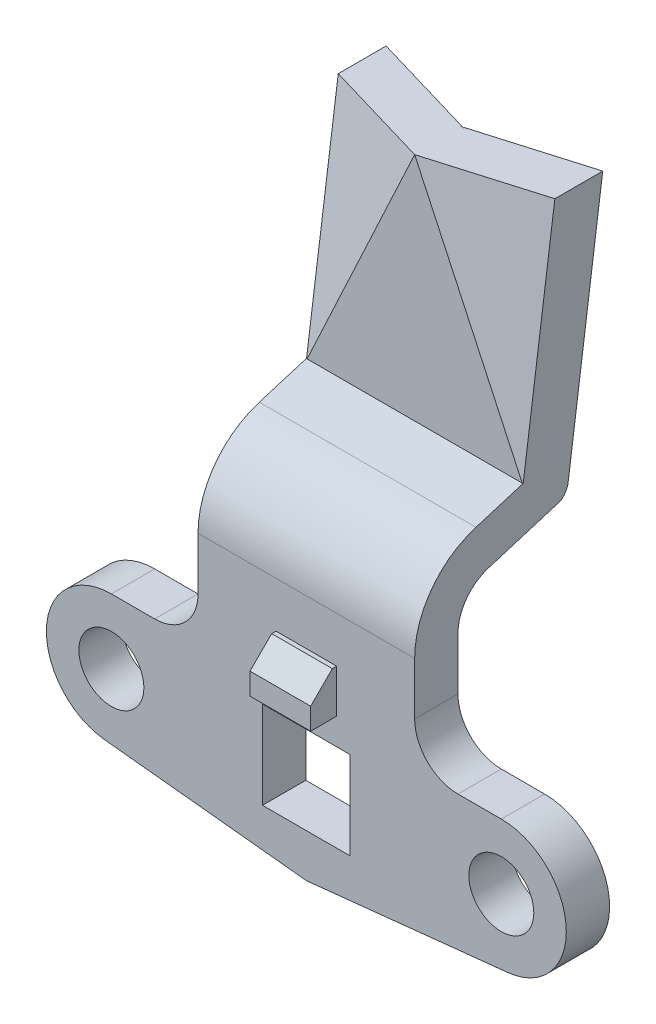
ISO-10303-21;
HEADER;
FILE_DESCRIPTION(('STEP AP214'),'2;1');
FILE_NAME('part.step','',(''),(''),'','','');
FILE_SCHEMA(('AUTOMOTIVE_DESIGN { 1 0 10303 214 1 1 1 1 }'));
ENDSEC;
DATA;
#1=APPLICATION_CONTEXT('core data for automotive mechanical design processes');
#2=APPLICATION_PROTOCOL_DEFINITION('international standard','automotive_design',2000,#1);
#3=PRODUCT_CONTEXT('',#1,'mechanical');
#4=PRODUCT('Part','Part','',(#3));
#5=PRODUCT_RELATED_PRODUCT_CATEGORY('part','',(#4));
#6=PRODUCT_DEFINITION_FORMATION('','',#4);
#7=PRODUCT_DEFINITION_CONTEXT('part definition',#1,'design');
#8=PRODUCT_DEFINITION('design','',#6,#7);
#9=PRODUCT_DEFINITION_SHAPE('','',#8);
#10=(LENGTH_UNIT() NAMED_UNIT(*) SI_UNIT(.MILLI.,.METRE.));
#11=(NAMED_UNIT(*) PLANE_ANGLE_UNIT() SI_UNIT($,.RADIAN.));
#12=(NAMED_UNIT(*) SI_UNIT($,.STERADIAN.) SOLID_ANGLE_UNIT());
#13=UNCERTAINTY_MEASURE_WITH_UNIT(LENGTH_MEASURE(1.E-05),#10,'distance_accuracy_value','');
#14=(GEOMETRIC_REPRESENTATION_CONTEXT(3) GLOBAL_UNCERTAINTY_ASSIGNED_CONTEXT((#13)) GLOBAL_UNIT_ASSIGNED_CONTEXT((#10,
#11,#12)) REPRESENTATION_CONTEXT('',''));
#15=CARTESIAN_POINT('',(0.,0.,0.));
#16=DIRECTION('',(0.,0.,1.));
#17=DIRECTION('',(1.,0.,0.));
#18=AXIS2_PLACEMENT_3D('',#15,#16,#17);
#19=CARTESIAN_POINT('',(-24.,14.7228488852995,0.));
#20=DIRECTION('',(0.,0.,1.));
#21=DIRECTION('',(0.,1.,0.));
#22=AXIS2_PLACEMENT_3D('',#19,#20,#21);
#23=PLANE('',#22);
#24=DIRECTION('',(0.,-1.,0.));
#25=VECTOR('',#24,1.);
#26=CARTESIAN_POINT('',(-2.8,10.5,0.));
#27=LINE('',#26,#25);
#28=CARTESIAN_POINT('',(-2.8,10.5,0.));
#29=VERTEX_POINT('',#28);
#30=CARTESIAN_POINT('',(-2.8,6.5,0.));
#31=VERTEX_POINT('',#30);
#32=EDGE_CURVE('E285',#29,#31,#27,.T.);
#33=ORIENTED_EDGE('',*,*,#32,.F.);
#34=DIRECTION('',(1.,0.,0.));
#35=VECTOR('',#34,1.);
#36=CARTESIAN_POINT('',(-2.8,10.5,0.));
#37=LINE('',#36,#35);
#38=CARTESIAN_POINT('',(2.8,10.5,0.));
#39=VERTEX_POINT('',#38);
#40=EDGE_CURVE('E278',#29,#39,#37,.T.);
#41=ORIENTED_EDGE('',*,*,#40,.T.);
#42=DIRECTION('',(0.,1.,0.));
#43=VECTOR('',#42,1.);
#44=CARTESIAN_POINT('',(2.8,6.5,0.));
#45=LINE('',#44,#43);
#46=CARTESIAN_POINT('',(2.8,6.5,0.));
#47=VERTEX_POINT('',#46);
#48=EDGE_CURVE('E280',#47,#39,#45,.T.);
#49=ORIENTED_EDGE('',*,*,#48,.F.);
#50=DIRECTION('',(-1.,0.,0.));
#51=VECTOR('',#50,1.);
#52=CARTESIAN_POINT('',(2.8,6.5,0.));
#53=LINE('',#52,#51);
#54=EDGE_CURVE('E283',#47,#31,#53,.T.);
#55=ORIENTED_EDGE('',*,*,#54,.T.);
#56=EDGE_LOOP('',(#33,#41,#49,#55));
#57=FACE_BOUND('',#56,.T.);
#58=CARTESIAN_POINT('',(14.,9.87492591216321,0.));
#59=DIRECTION('',(0.,0.,-1.));
#60=DIRECTION('',(0.,-1.,0.));
#61=AXIS2_PLACEMENT_3D('',#58,#59,#60);
#62=CIRCLE('',#61,4.);
#63=CARTESIAN_POINT('',(14.,5.87492591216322,0.));
#64=VERTEX_POINT('',#63);
#65=CARTESIAN_POINT('',(10.,9.87492591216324,0.));
#66=VERTEX_POINT('',#65);
#67=EDGE_CURVE('E362',#64,#66,#62,.T.);
#68=ORIENTED_EDGE('',*,*,#67,.T.);
#69=DIRECTION('',(0.,1.,0.));
#70=VECTOR('',#69,1.);
#71=CARTESIAN_POINT('',(10.,9.87492591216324,0.));
#72=LINE('',#71,#70);
#73=CARTESIAN_POINT('',(10.,14.7228488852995,0.));
#74=VERTEX_POINT('',#73);
#75=EDGE_CURVE('E365',#66,#74,#72,.T.);
#76=ORIENTED_EDGE('',*,*,#75,.T.);
#77=DIRECTION('',(1.,0.,0.));
#78=VECTOR('',#77,1.);
#79=CARTESIAN_POINT('',(-24.,14.7228488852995,0.));
#80=LINE('',#79,#78);
#81=CARTESIAN_POINT('',(-10.,14.7228488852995,0.));
#82=VERTEX_POINT('',#81);
#83=EDGE_CURVE('E614',#82,#74,#80,.T.);
#84=ORIENTED_EDGE('',*,*,#83,.F.);
#85=DIRECTION('',(0.,1.,0.));
#86=VECTOR('',#85,1.);
#87=CARTESIAN_POINT('',(-10.,9.87492591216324,0.));
#88=LINE('',#87,#86);
#89=CARTESIAN_POINT('',(-10.,9.87492591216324,0.));
#90=VERTEX_POINT('',#89);
#91=EDGE_CURVE('E368',#90,#82,#88,.T.);
#92=ORIENTED_EDGE('',*,*,#91,.F.);
#93=CARTESIAN_POINT('',(-14.,9.87492591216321,0.));
#94=DIRECTION('',(0.,0.,1.));
#95=DIRECTION('',(0.,1.,0.));
#96=AXIS2_PLACEMENT_3D('',#93,#94,#95);
#97=CIRCLE('',#96,4.);
#98=CARTESIAN_POINT('',(-14.,5.87492591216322,0.));
#99=VERTEX_POINT('',#98);
#100=EDGE_CURVE('E370',#99,#90,#97,.T.);
#101=ORIENTED_EDGE('',*,*,#100,.F.);
#102=DIRECTION('',(1.,0.,0.));
#103=VECTOR('',#102,1.);
#104=CARTESIAN_POINT('',(-18.,5.87492591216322,0.));
#105=LINE('',#104,#103);
#106=CARTESIAN_POINT('',(-18.,5.87492591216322,0.));
#107=VERTEX_POINT('',#106);
#108=EDGE_CURVE('E373',#107,#99,#105,.T.);
#109=ORIENTED_EDGE('',*,*,#108,.F.);
#110=CARTESIAN_POINT('',(-18.,-0.125074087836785,0.));
#111=DIRECTION('',(0.,0.,1.));
#112=DIRECTION('',(0.,1.,0.));
#113=AXIS2_PLACEMENT_3D('',#110,#111,#112);
#114=CIRCLE('',#113,6.);
#115=CARTESIAN_POINT('',(-18.6271707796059,-6.09220546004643,0.));
#116=VERTEX_POINT('',#115);
#117=EDGE_CURVE('E376',#107,#116,#114,.T.);
#118=ORIENTED_EDGE('',*,*,#117,.T.);
#119=DIRECTION('',(-0.994521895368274,0.10452846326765,0.));
#120=VECTOR('',#119,1.);
#121=CARTESIAN_POINT('',(0.,-8.05,0.));
#122=LINE('',#121,#120);
#123=CARTESIAN_POINT('',(0.,-8.05,0.));
#124=VERTEX_POINT('',#123);
#125=EDGE_CURVE('E378',#124,#116,#122,.T.);
#126=ORIENTED_EDGE('',*,*,#125,.F.);
#127=DIRECTION('',(0.994521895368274,0.10452846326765,0.));
#128=VECTOR('',#127,1.);
#129=CARTESIAN_POINT('',(0.,-8.05,0.));
#130=LINE('',#129,#128);
#131=CARTESIAN_POINT('',(18.6271707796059,-6.09220546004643,0.));
#132=VERTEX_POINT('',#131);
#133=EDGE_CURVE('E353',#124,#132,#130,.T.);
#134=ORIENTED_EDGE('',*,*,#133,.T.);
#135=CARTESIAN_POINT('',(18.,-0.125074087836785,0.));
#136=DIRECTION('',(0.,0.,-1.));
#137=DIRECTION('',(0.,-1.,0.));
#138=AXIS2_PLACEMENT_3D('',#135,#136,#137);
#139=CIRCLE('',#138,6.);
#140=CARTESIAN_POINT('',(18.,5.87492591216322,0.));
#141=VERTEX_POINT('',#140);
#142=EDGE_CURVE('E356',#141,#132,#139,.T.);
#143=ORIENTED_EDGE('',*,*,#142,.F.);
#144=DIRECTION('',(-1.,0.,0.));
#145=VECTOR('',#144,1.);
#146=CARTESIAN_POINT('',(18.,5.87492591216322,0.));
#147=LINE('',#146,#145);
#148=EDGE_CURVE('E359',#141,#64,#147,.T.);
#149=ORIENTED_EDGE('',*,*,#148,.T.);
#150=EDGE_LOOP('',(#68,#76,#84,#92,#101,#109,#118,#126,#134,#143,#149));
#151=FACE_BOUND('',#150,.T.);
#152=DIRECTION('',(0.,1.,0.));
#153=VECTOR('',#152,1.);
#154=CARTESIAN_POINT('',(-4.05,-4.05,0.));
#155=LINE('',#154,#153);
#156=CARTESIAN_POINT('',(-4.05,-4.05,0.));
#157=VERTEX_POINT('',#156);
#158=CARTESIAN_POINT('',(-4.05,4.05,0.));
#159=VERTEX_POINT('',#158);
#160=EDGE_CURVE('E320',#157,#159,#155,.T.);
#161=ORIENTED_EDGE('',*,*,#160,.T.);
#162=DIRECTION('',(-1.,0.,0.));
#163=VECTOR('',#162,1.);
#164=CARTESIAN_POINT('',(4.05,4.05,0.));
#165=LINE('',#164,#163);
#166=CARTESIAN_POINT('',(4.05,4.05,0.));
#167=VERTEX_POINT('',#166);
#168=EDGE_CURVE('E317',#167,#159,#165,.T.);
#169=ORIENTED_EDGE('',*,*,#168,.F.);
#170=DIRECTION('',(0.,-1.,0.));
#171=VECTOR('',#170,1.);
#172=CARTESIAN_POINT('',(4.05,4.05,0.));
#173=LINE('',#172,#171);
#174=CARTESIAN_POINT('',(4.05,-4.05,0.));
#175=VERTEX_POINT('',#174);
#176=EDGE_CURVE('E325',#167,#175,#173,.T.);
#177=ORIENTED_EDGE('',*,*,#176,.T.);
#178=DIRECTION('',(1.,0.,0.));
#179=VECTOR('',#178,1.);
#180=CARTESIAN_POINT('',(-4.05,-4.05,0.));
#181=LINE('',#180,#179);
#182=EDGE_CURVE('E323',#157,#175,#181,.T.);
#183=ORIENTED_EDGE('',*,*,#182,.F.);
#184=EDGE_LOOP('',(#161,#169,#177,#183));
#185=FACE_BOUND('',#184,.T.);
#186=CARTESIAN_POINT('',(-18.,-0.125074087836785,0.));
#187=DIRECTION('',(0.,0.,1.));
#188=DIRECTION('',(0.,1.,0.));
#189=AXIS2_PLACEMENT_3D('',#186,#187,#188);
#190=CIRCLE('',#189,3.);
#191=CARTESIAN_POINT('',(-18.,2.87492591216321,0.));
#192=VERTEX_POINT('',#191);
#193=EDGE_CURVE('E518',#192,#192,#190,.T.);
#194=ORIENTED_EDGE('',*,*,#193,.F.);
#195=EDGE_LOOP('',(#194));
#196=FACE_BOUND('',#195,.T.);
#197=CARTESIAN_POINT('',(18.,-0.125074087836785,0.));
#198=DIRECTION('',(0.,0.,-1.));
#199=DIRECTION('',(0.,-1.,0.));
#200=AXIS2_PLACEMENT_3D('',#197,#198,#199);
#201=CIRCLE('',#200,3.);
#202=CARTESIAN_POINT('',(18.,-3.12507408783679,0.));
#203=VERTEX_POINT('',#202);
#204=EDGE_CURVE('E525',#203,#203,#201,.T.);
#205=ORIENTED_EDGE('',*,*,#204,.T.);
#206=EDGE_LOOP('',(#205));
#207=FACE_BOUND('',#206,.T.);
#208=ADVANCED_FACE('F14',(#57,#151,#185,#196,#207),#23,.T.);
#209=CARTESIAN_POINT('',(-24.,14.7228488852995,-4.));
#210=DIRECTION('',(0.,0.,1.));
#211=DIRECTION('',(0.,1.,0.));
#212=AXIS2_PLACEMENT_3D('',#209,#210,#211);
#213=PLANE('',#212);
#214=DIRECTION('',(-1.,0.,0.));
#215=VECTOR('',#214,1.);
#216=CARTESIAN_POINT('',(4.05,4.05,-4.));
#217=LINE('',#216,#215);
#218=CARTESIAN_POINT('',(4.05,4.05,-4.));
#219=VERTEX_POINT('',#218);
#220=CARTESIAN_POINT('',(-4.05,4.05,-4.));
#221=VERTEX_POINT('',#220);
#222=EDGE_CURVE('E305',#219,#221,#217,.T.);
#223=ORIENTED_EDGE('',*,*,#222,.T.);
#224=DIRECTION('',(0.,1.,0.));
#225=VECTOR('',#224,1.);
#226=CARTESIAN_POINT('',(-4.05,-4.05,-4.));
#227=LINE('',#226,#225);
#228=CARTESIAN_POINT('',(-4.05,-4.05,-4.));
#229=VERTEX_POINT('',#228);
#230=EDGE_CURVE('E308',#229,#221,#227,.T.);
#231=ORIENTED_EDGE('',*,*,#230,.F.);
#232=DIRECTION('',(1.,0.,0.));
#233=VECTOR('',#232,1.);
#234=CARTESIAN_POINT('',(-4.05,-4.05,-4.));
#235=LINE('',#234,#233);
#236=CARTESIAN_POINT('',(4.05,-4.05,-4.));
#237=VERTEX_POINT('',#236);
#238=EDGE_CURVE('E311',#229,#237,#235,.T.);
#239=ORIENTED_EDGE('',*,*,#238,.T.);
#240=DIRECTION('',(0.,-1.,0.));
#241=VECTOR('',#240,1.);
#242=CARTESIAN_POINT('',(4.05,4.05,-4.));
#243=LINE('',#242,#241);
#244=EDGE_CURVE('E314',#219,#237,#243,.T.);
#245=ORIENTED_EDGE('',*,*,#244,.F.);
#246=EDGE_LOOP('',(#223,#231,#239,#245));
#247=FACE_BOUND('',#246,.T.);
#248=DIRECTION('',(0.,1.,0.));
#249=VECTOR('',#248,1.);
#250=CARTESIAN_POINT('',(10.,14.7228488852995,-4.));
#251=LINE('',#250,#249);
#252=CARTESIAN_POINT('',(10.,9.87492591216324,-4.));
#253=VERTEX_POINT('',#252);
#254=CARTESIAN_POINT('',(10.,14.7228488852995,-4.));
#255=VERTEX_POINT('',#254);
#256=EDGE_CURVE('E629',#253,#255,#251,.T.);
#257=ORIENTED_EDGE('',*,*,#256,.F.);
#258=CARTESIAN_POINT('',(14.,9.87492591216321,-4.));
#259=DIRECTION('',(0.,0.,1.));
#260=DIRECTION('',(0.,1.,0.));
#261=AXIS2_PLACEMENT_3D('',#258,#259,#260);
#262=CIRCLE('',#261,4.);
#263=CARTESIAN_POINT('',(14.,5.87492591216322,-4.));
#264=VERTEX_POINT('',#263);
#265=EDGE_CURVE('E732',#264,#253,#262,.F.);
#266=ORIENTED_EDGE('',*,*,#265,.F.);
#267=DIRECTION('',(-1.,0.,0.));
#268=VECTOR('',#267,1.);
#269=CARTESIAN_POINT('',(-24.,5.87492591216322,-4.));
#270=LINE('',#269,#268);
#271=CARTESIAN_POINT('',(18.,5.87492591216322,-4.));
#272=VERTEX_POINT('',#271);
#273=EDGE_CURVE('E734',#272,#264,#270,.T.);
#274=ORIENTED_EDGE('',*,*,#273,.F.);
#275=CARTESIAN_POINT('',(18.,-0.125074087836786,-4.));
#276=DIRECTION('',(0.,0.,1.));
#277=DIRECTION('',(0.,1.,0.));
#278=AXIS2_PLACEMENT_3D('',#275,#276,#277);
#279=CIRCLE('',#278,6.);
#280=CARTESIAN_POINT('',(18.6271707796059,-6.09220546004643,-4.));
#281=VERTEX_POINT('',#280);
#282=EDGE_CURVE('E801',#272,#281,#279,.F.);
#283=ORIENTED_EDGE('',*,*,#282,.T.);
#284=DIRECTION('',(0.994521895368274,0.10452846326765,0.));
#285=VECTOR('',#284,1.);
#286=CARTESIAN_POINT('',(-21.3704004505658,-10.2961195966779,-4.));
#287=LINE('',#286,#285);
#288=CARTESIAN_POINT('',(0.,-8.05,-4.));
#289=VERTEX_POINT('',#288);
#290=EDGE_CURVE('E736',#289,#281,#287,.T.);
#291=ORIENTED_EDGE('',*,*,#290,.F.);
#292=DIRECTION('',(-0.994521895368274,0.10452846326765,0.));
#293=VECTOR('',#292,1.);
#294=CARTESIAN_POINT('',(-26.1051419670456,-5.30623901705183,-4.));
#295=LINE('',#294,#293);
#296=CARTESIAN_POINT('',(-18.6271707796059,-6.09220546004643,-4.));
#297=VERTEX_POINT('',#296);
#298=EDGE_CURVE('E803',#289,#297,#295,.T.);
#299=ORIENTED_EDGE('',*,*,#298,.T.);
#300=CARTESIAN_POINT('',(-18.,-0.125074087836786,-4.));
#301=DIRECTION('',(0.,0.,1.));
#302=DIRECTION('',(0.,1.,0.));
#303=AXIS2_PLACEMENT_3D('',#300,#301,#302);
#304=CIRCLE('',#303,6.);
#305=CARTESIAN_POINT('',(-18.,5.87492591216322,-4.));
#306=VERTEX_POINT('',#305);
#307=EDGE_CURVE('E806',#306,#297,#304,.T.);
#308=ORIENTED_EDGE('',*,*,#307,.F.);
#309=DIRECTION('',(1.,0.,0.));
#310=VECTOR('',#309,1.);
#311=CARTESIAN_POINT('',(-24.,5.87492591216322,-4.));
#312=LINE('',#311,#310);
#313=CARTESIAN_POINT('',(-14.,5.87492591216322,-4.));
#314=VERTEX_POINT('',#313);
#315=EDGE_CURVE('E738',#306,#314,#312,.T.);
#316=ORIENTED_EDGE('',*,*,#315,.T.);
#317=CARTESIAN_POINT('',(-14.,9.87492591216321,-4.));
#318=DIRECTION('',(0.,0.,1.));
#319=DIRECTION('',(0.,1.,0.));
#320=AXIS2_PLACEMENT_3D('',#317,#318,#319);
#321=CIRCLE('',#320,4.);
#322=CARTESIAN_POINT('',(-10.,9.87492591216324,-4.));
#323=VERTEX_POINT('',#322);
#324=EDGE_CURVE('E606',#314,#323,#321,.T.);
#325=ORIENTED_EDGE('',*,*,#324,.T.);
#326=DIRECTION('',(0.,1.,0.));
#327=VECTOR('',#326,1.);
#328=CARTESIAN_POINT('',(-10.,14.7228488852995,-4.));
#329=LINE('',#328,#327);
#330=CARTESIAN_POINT('',(-10.,14.7228488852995,-4.));
#331=VERTEX_POINT('',#330);
#332=EDGE_CURVE('E693',#323,#331,#329,.T.);
#333=ORIENTED_EDGE('',*,*,#332,.T.);
#334=DIRECTION('',(1.,0.,0.));
#335=VECTOR('',#334,1.);
#336=CARTESIAN_POINT('',(-24.,14.7228488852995,-4.));
#337=LINE('',#336,#335);
#338=EDGE_CURVE('E511',#331,#255,#337,.T.);
#339=ORIENTED_EDGE('',*,*,#338,.T.);
#340=EDGE_LOOP('',(#257,#266,#274,#283,#291,#299,#308,#316,#325,#333,#339));
#341=FACE_BOUND('',#340,.T.);
#342=CARTESIAN_POINT('',(-18.,-0.125074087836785,-4.));
#343=DIRECTION('',(0.,0.,1.));
#344=DIRECTION('',(0.,1.,0.));
#345=AXIS2_PLACEMENT_3D('',#342,#343,#344);
#346=CIRCLE('',#345,3.);
#347=CARTESIAN_POINT('',(-18.,2.87492591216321,-4.));
#348=VERTEX_POINT('',#347);
#349=EDGE_CURVE('E257',#348,#348,#346,.T.);
#350=ORIENTED_EDGE('',*,*,#349,.T.);
#351=EDGE_LOOP('',(#350));
#352=FACE_BOUND('',#351,.T.);
#353=CARTESIAN_POINT('',(18.,-0.125074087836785,-4.));
#354=DIRECTION('',(0.,0.,1.));
#355=DIRECTION('',(0.,1.,0.));
#356=AXIS2_PLACEMENT_3D('',#353,#354,#355);
#357=CIRCLE('',#356,3.);
#358=CARTESIAN_POINT('',(18.,2.87492591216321,-4.));
#359=VERTEX_POINT('',#358);
#360=EDGE_CURVE('E18',#359,#359,#357,.F.);
#361=ORIENTED_EDGE('',*,*,#360,.F.);
#362=EDGE_LOOP('',(#361));
#363=FACE_BOUND('',#362,.T.);
#364=ADVANCED_FACE('F453',(#247,#341,#352,#363),#213,.F.);
#365=CARTESIAN_POINT('',(-56.0267452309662,68.0503983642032,-34.0861046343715));
#366=DIRECTION('',(-0.280064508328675,0.130596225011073,0.951056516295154));
#367=DIRECTION('',(-0.959272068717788,0.,-0.282483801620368));
#368=AXIS2_PLACEMENT_3D('',#365,#366,#367);
#369=PLANE('',#368);
#370=DIRECTION('',(-0.0437421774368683,0.987938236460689,-0.148541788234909));
#371=VECTOR('',#370,1.);
#372=CARTESIAN_POINT('',(-1.36672153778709,72.7927650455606,-18.6411786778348));
#373=LINE('',#372,#371);
#374=CARTESIAN_POINT('',(0.,41.9246980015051,-14.));
#375=VERTEX_POINT('',#374);
#376=CARTESIAN_POINT('',(-0.136162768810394,45.,-14.4623880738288));
#377=VERTEX_POINT('',#376);
#378=EDGE_CURVE('E247',#375,#377,#373,.T.);
#379=ORIENTED_EDGE('',*,*,#378,.F.);
#380=DIRECTION('',(0.422618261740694,0.906307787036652,0.));
#381=VECTOR('',#380,1.);
#382=CARTESIAN_POINT('',(2.67659292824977,47.6646700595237,-14.));
#383=LINE('',#382,#381);
#384=CARTESIAN_POINT('',(-9.53353739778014,21.4799610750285,-14.));
#385=VERTEX_POINT('',#384);
#386=EDGE_CURVE('E672',#375,#385,#383,.F.);
#387=ORIENTED_EDGE('',*,*,#386,.T.);
#388=DIRECTION('',(0.861949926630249,-0.401933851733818,0.309016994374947));
#389=VECTOR('',#388,1.);
#390=CARTESIAN_POINT('',(-65.5602826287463,47.6056614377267,-34.0861046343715));
#391=LINE('',#390,#389);
#392=CARTESIAN_POINT('',(-10.,21.6974761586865,-14.1672311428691));
#393=VERTEX_POINT('',#392);
#394=EDGE_CURVE('E659',#393,#385,#391,.T.);
#395=ORIENTED_EDGE('',*,*,#394,.F.);
#396=DIRECTION('',(0.,0.990703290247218,-0.136040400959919));
#397=VECTOR('',#396,1.);
#398=CARTESIAN_POINT('',(-10.,69.8771248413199,-20.7831158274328));
#399=LINE('',#398,#397);
#400=CARTESIAN_POINT('',(-10.,45.,-17.367063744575));
#401=VERTEX_POINT('',#400);
#402=EDGE_CURVE('E627',#393,#401,#399,.T.);
#403=ORIENTED_EDGE('',*,*,#402,.T.);
#404=DIRECTION('',(0.959272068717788,0.,0.282483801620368));
#405=VECTOR('',#404,1.);
#406=CARTESIAN_POINT('',(-56.884450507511,45.,-31.1734678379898));
#407=LINE('',#406,#405);
#408=EDGE_CURVE('E337',#401,#377,#407,.T.);
#409=ORIENTED_EDGE('',*,*,#408,.T.);
#410=EDGE_LOOP('',(#379,#387,#395,#403,#409));
#411=FACE_BOUND('',#410,.T.);
#412=ADVANCED_FACE('F460',(#411),#369,.F.);
#413=CARTESIAN_POINT('',(32.7372831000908,45.,36.));
#414=DIRECTION('',(0.,-1.,0.));
#415=DIRECTION('',(1.,0.,0.));
#416=AXIS2_PLACEMENT_3D('',#413,#414,#415);
#417=PLANE('',#416);
#418=DIRECTION('',(0.959272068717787,0.,-0.28248380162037));
#419=VECTOR('',#418,1.);
#420=CARTESIAN_POINT('',(43.7345921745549,45.,-27.3011337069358));
#421=LINE('',#420,#419);
#422=CARTESIAN_POINT('',(0.136162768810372,45.,-14.4623880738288));
#423=VERTEX_POINT('',#422);
#424=CARTESIAN_POINT('',(10.,45.,-17.367063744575));
#425=VERTEX_POINT('',#424);
#426=EDGE_CURVE('E339',#423,#425,#421,.T.);
#427=ORIENTED_EDGE('',*,*,#426,.F.);
#428=DIRECTION('',(-0.282483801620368,0.,0.959272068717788));
#429=VECTOR('',#428,1.);
#430=CARTESIAN_POINT('',(-10.9366008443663,45.,23.1390347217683));
#431=LINE('',#430,#429);
#432=CARTESIAN_POINT('',(0.1144319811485,45.,-14.3885936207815));
#433=VERTEX_POINT('',#432);
#434=EDGE_CURVE('E23',#423,#433,#431,.T.);
#435=ORIENTED_EDGE('',*,*,#434,.T.);
#436=CARTESIAN_POINT('',(0.,45.,-14.4222912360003));
#437=VERTEX_POINT('',#436);
#438=EDGE_CURVE('E262',#437,#433,#407,.T.);
#439=ORIENTED_EDGE('',*,*,#438,.F.);
#440=DIRECTION('',(-0.959272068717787,0.,0.282483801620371));
#441=VECTOR('',#440,1.);
#442=CARTESIAN_POINT('',(16.4615698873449,45.,-19.2698490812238));
#443=LINE('',#442,#441);
#444=CARTESIAN_POINT('',(-0.114431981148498,45.,-14.3885936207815));
#445=VERTEX_POINT('',#444);
#446=EDGE_CURVE('E255',#437,#445,#443,.T.);
#447=ORIENTED_EDGE('',*,*,#446,.T.);
#448=DIRECTION('',(0.28248380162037,0.,0.959272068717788));
#449=VECTOR('',#448,1.);
#450=CARTESIAN_POINT('',(16.1612812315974,45.,40.8812554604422));
#451=LINE('',#450,#449);
#452=EDGE_CURVE('E241',#377,#445,#451,.T.);
#453=ORIENTED_EDGE('',*,*,#452,.F.);
#454=ORIENTED_EDGE('',*,*,#408,.F.);
#455=DIRECTION('',(0.,0.,-1.));
#456=VECTOR('',#455,1.);
#457=CARTESIAN_POINT('',(-10.,45.,-100.));
#458=LINE('',#457,#456);
#459=CARTESIAN_POINT('',(-10.,45.,-12.9447725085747));
#460=VERTEX_POINT('',#459);
#461=EDGE_CURVE('E344',#460,#401,#458,.T.);
#462=ORIENTED_EDGE('',*,*,#461,.F.);
#463=DIRECTION('',(-0.959272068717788,0.,-0.282483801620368));
#464=VECTOR('',#463,1.);
#465=CARTESIAN_POINT('',(-66.1387294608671,45.,-29.4763512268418));
#466=LINE('',#465,#464);
#467=CARTESIAN_POINT('',(0.,45.,-10.));
#468=VERTEX_POINT('',#467);
#469=EDGE_CURVE('E347',#468,#460,#466,.T.);
#470=ORIENTED_EDGE('',*,*,#469,.F.);
#471=DIRECTION('',(-0.959272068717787,0.,0.28248380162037));
#472=VECTOR('',#471,1.);
#473=CARTESIAN_POINT('',(44.2160823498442,45.,-23.0206303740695));
#474=LINE('',#473,#472);
#475=CARTESIAN_POINT('',(10.,45.,-12.9447725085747));
#476=VERTEX_POINT('',#475);
#477=EDGE_CURVE('E350',#476,#468,#474,.T.);
#478=ORIENTED_EDGE('',*,*,#477,.F.);
#479=DIRECTION('',(0.,0.,-1.));
#480=VECTOR('',#479,1.);
#481=CARTESIAN_POINT('',(10.,45.,-100.));
#482=LINE('',#481,#480);
#483=EDGE_CURVE('E342',#476,#425,#482,.T.);
#484=ORIENTED_EDGE('',*,*,#483,.T.);
#485=EDGE_LOOP('',(#427,#435,#439,#447,#453,#454,#462,#470,#478,#484));
#486=FACE_BOUND('',#485,.T.);
#487=ADVANCED_FACE('F260',(#486),#417,.F.);
#488=CARTESIAN_POINT('',(-2.8,10.5,2.4));
#489=DIRECTION('',(0.,1.,0.));
#490=DIRECTION('',(0.,0.,-1.));
#491=AXIS2_PLACEMENT_3D('',#488,#489,#490);
#492=PLANE('',#491);
#493=DIRECTION('',(0.,0.,-1.));
#494=VECTOR('',#493,1.);
#495=CARTESIAN_POINT('',(-2.8,10.5,2.4));
#496=LINE('',#495,#494);
#497=CARTESIAN_POINT('',(-2.8,10.5,0.4));
#498=VERTEX_POINT('',#497);
#499=EDGE_CURVE('E303',#498,#29,#496,.T.);
#500=ORIENTED_EDGE('',*,*,#499,.F.);
#501=DIRECTION('',(-1.,0.,0.));
#502=VECTOR('',#501,1.);
#503=CARTESIAN_POINT('',(24.,10.5,0.4));
#504=LINE('',#503,#502);
#505=CARTESIAN_POINT('',(2.8,10.5,0.4));
#506=VERTEX_POINT('',#505);
#507=EDGE_CURVE('E272',#506,#498,#504,.T.);
#508=ORIENTED_EDGE('',*,*,#507,.F.);
#509=DIRECTION('',(0.,0.,-1.));
#510=VECTOR('',#509,1.);
#511=CARTESIAN_POINT('',(2.8,10.5,2.4));
#512=LINE('',#511,#510);
#513=EDGE_CURVE('E39',#506,#39,#512,.T.);
#514=ORIENTED_EDGE('',*,*,#513,.T.);
#515=ORIENTED_EDGE('',*,*,#40,.F.);
#516=EDGE_LOOP('',(#500,#508,#514,#515));
#517=FACE_BOUND('',#516,.T.);
#518=ADVANCED_FACE('F556',(#517),#492,.T.);
#519=CARTESIAN_POINT('',(-2.8,10.5,2.4));
#520=DIRECTION('',(1.,0.,0.));
#521=DIRECTION('',(0.,1.,0.));
#522=AXIS2_PLACEMENT_3D('',#519,#520,#521);
#523=PLANE('',#522);
#524=DIRECTION('',(0.,0.707106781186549,-0.707106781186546));
#525=VECTOR('',#524,1.);
#526=CARTESIAN_POINT('',(-2.8,8.5,2.4));
#527=LINE('',#526,#525);
#528=CARTESIAN_POINT('',(-2.8,8.5,2.4));
#529=VERTEX_POINT('',#528);
#530=EDGE_CURVE('E31',#529,#498,#527,.T.);
#531=ORIENTED_EDGE('',*,*,#530,.T.);
#532=ORIENTED_EDGE('',*,*,#499,.T.);
#533=ORIENTED_EDGE('',*,*,#32,.T.);
#534=DIRECTION('',(0.,0.,-1.));
#535=VECTOR('',#534,1.);
#536=CARTESIAN_POINT('',(-2.8,6.5,2.4));
#537=LINE('',#536,#535);
#538=CARTESIAN_POINT('',(-2.8,6.5,2.4));
#539=VERTEX_POINT('',#538);
#540=EDGE_CURVE('E300',#539,#31,#537,.T.);
#541=ORIENTED_EDGE('',*,*,#540,.F.);
#542=DIRECTION('',(0.,-1.,0.));
#543=VECTOR('',#542,1.);
#544=CARTESIAN_POINT('',(-2.8,10.5,2.4));
#545=LINE('',#544,#543);
#546=EDGE_CURVE('E294',#529,#539,#545,.T.);
#547=ORIENTED_EDGE('',*,*,#546,.F.);
#548=EDGE_LOOP('',(#531,#532,#533,#541,#547));
#549=FACE_BOUND('',#548,.T.);
#550=ADVANCED_FACE('F559',(#549),#523,.F.);
#551=CARTESIAN_POINT('',(2.8,6.5,2.4));
#552=DIRECTION('',(-1.,0.,0.));
#553=DIRECTION('',(0.,-1.,0.));
#554=AXIS2_PLACEMENT_3D('',#551,#552,#553);
#555=PLANE('',#554);
#556=DIRECTION('',(0.,0.707106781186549,-0.707106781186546));
#557=VECTOR('',#556,1.);
#558=CARTESIAN_POINT('',(2.8,7.5,3.4));
#559=LINE('',#558,#557);
#560=CARTESIAN_POINT('',(2.8,8.5,2.4));
#561=VERTEX_POINT('',#560);
#562=EDGE_CURVE('E276',#561,#506,#559,.T.);
#563=ORIENTED_EDGE('',*,*,#562,.F.);
#564=DIRECTION('',(0.,1.,0.));
#565=VECTOR('',#564,1.);
#566=CARTESIAN_POINT('',(2.8,6.5,2.4));
#567=LINE('',#566,#565);
#568=CARTESIAN_POINT('',(2.8,6.5,2.4));
#569=VERTEX_POINT('',#568);
#570=EDGE_CURVE('E288',#569,#561,#567,.T.);
#571=ORIENTED_EDGE('',*,*,#570,.F.);
#572=DIRECTION('',(0.,0.,-1.));
#573=VECTOR('',#572,1.);
#574=CARTESIAN_POINT('',(2.8,6.5,2.4));
#575=LINE('',#574,#573);
#576=EDGE_CURVE('E297',#569,#47,#575,.T.);
#577=ORIENTED_EDGE('',*,*,#576,.T.);
#578=ORIENTED_EDGE('',*,*,#48,.T.);
#579=ORIENTED_EDGE('',*,*,#513,.F.);
#580=EDGE_LOOP('',(#563,#571,#577,#578,#579));
#581=FACE_BOUND('',#580,.T.);
#582=ADVANCED_FACE('F484',(#581),#555,.F.);
#583=CARTESIAN_POINT('',(2.8,10.5,2.4));
#584=DIRECTION('',(0.,0.,1.));
#585=DIRECTION('',(-1.,0.,0.));
#586=AXIS2_PLACEMENT_3D('',#583,#584,#585);
#587=PLANE('',#586);
#588=ORIENTED_EDGE('',*,*,#570,.T.);
#589=DIRECTION('',(-1.,0.,0.));
#590=VECTOR('',#589,1.);
#591=CARTESIAN_POINT('',(24.,8.5,2.4));
#592=LINE('',#591,#590);
#593=EDGE_CURVE('E274',#561,#529,#592,.T.);
#594=ORIENTED_EDGE('',*,*,#593,.T.);
#595=ORIENTED_EDGE('',*,*,#546,.T.);
#596=DIRECTION('',(-1.,0.,0.));
#597=VECTOR('',#596,1.);
#598=CARTESIAN_POINT('',(2.8,6.5,2.4));
#599=LINE('',#598,#597);
#600=EDGE_CURVE('E291',#569,#539,#599,.T.);
#601=ORIENTED_EDGE('',*,*,#600,.F.);
#602=EDGE_LOOP('',(#588,#594,#595,#601));
#603=FACE_BOUND('',#602,.T.);
#604=ADVANCED_FACE('F478',(#603),#587,.T.);
#605=CARTESIAN_POINT('',(-24.,21.4799610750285,-13.));
#606=DIRECTION('',(1.,0.,0.));
#607=DIRECTION('',(0.,1.,0.));
#608=AXIS2_PLACEMENT_3D('',#605,#606,#607);
#609=CYLINDRICAL_SURFACE('',#608,1.);
#610=CARTESIAN_POINT('',(10.,21.4799610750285,-13.));
#611=DIRECTION('',(1.,0.,0.));
#612=DIRECTION('',(0.,1.,0.));
#613=AXIS2_PLACEMENT_3D('',#610,#611,#612);
#614=CIRCLE('',#613,1.);
#615=CARTESIAN_POINT('',(10.,20.5236563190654,-13.2923717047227));
#616=VERTEX_POINT('',#615);
#617=CARTESIAN_POINT('',(10.,20.7353039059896,-13.6674471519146));
#618=VERTEX_POINT('',#617);
#619=EDGE_CURVE('E490',#616,#618,#614,.T.);
#620=ORIENTED_EDGE('',*,*,#619,.F.);
#621=DIRECTION('',(1.,0.,0.));
#622=VECTOR('',#621,1.);
#623=CARTESIAN_POINT('',(-24.,20.5236563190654,-13.2923717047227));
#624=LINE('',#623,#622);
#625=CARTESIAN_POINT('',(-10.,20.5236563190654,-13.2923717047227));
#626=VERTEX_POINT('',#625);
#627=EDGE_CURVE('E493',#626,#616,#624,.T.);
#628=ORIENTED_EDGE('',*,*,#627,.F.);
#629=CARTESIAN_POINT('',(-10.,21.4799610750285,-13.));
#630=DIRECTION('',(1.,0.,0.));
#631=DIRECTION('',(0.,1.,0.));
#632=AXIS2_PLACEMENT_3D('',#629,#630,#631);
#633=CIRCLE('',#632,1.);
#634=CARTESIAN_POINT('',(-10.,20.7353039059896,-13.6674471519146));
#635=VERTEX_POINT('',#634);
#636=EDGE_CURVE('E642',#626,#635,#633,.T.);
#637=ORIENTED_EDGE('',*,*,#636,.T.);
#638=CARTESIAN_POINT('',(-9.89204661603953,21.4799610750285,-13.));
#639=DIRECTION('',(0.861949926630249,-0.401933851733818,0.309016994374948));
#640=DIRECTION('',(0.506993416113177,0.683336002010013,-0.52536614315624));
#641=AXIS2_PLACEMENT_3D('',#638,#639,#640);
#642=ELLIPSE('',#641,1.16016020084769,1.);
#643=EDGE_CURVE('E679',#385,#635,#642,.F.);
#644=ORIENTED_EDGE('',*,*,#643,.F.);
#645=DIRECTION('',(1.,0.,0.));
#646=VECTOR('',#645,1.);
#647=CARTESIAN_POINT('',(-24.,21.4799610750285,-14.));
#648=LINE('',#647,#646);
#649=CARTESIAN_POINT('',(9.53353739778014,21.4799610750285,-14.));
#650=VERTEX_POINT('',#649);
#651=EDGE_CURVE('E506',#385,#650,#648,.T.);
#652=ORIENTED_EDGE('',*,*,#651,.T.);
#653=CARTESIAN_POINT('',(9.89204661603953,21.4799610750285,-13.));
#654=DIRECTION('',(-0.861949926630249,-0.401933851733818,0.309016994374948));
#655=DIRECTION('',(0.506993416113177,-0.683336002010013,0.52536614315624));
#656=AXIS2_PLACEMENT_3D('',#653,#654,#655);
#657=ELLIPSE('',#656,1.16016020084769,1.);
#658=EDGE_CURVE('E496',#650,#618,#657,.T.);
#659=ORIENTED_EDGE('',*,*,#658,.T.);
#660=EDGE_LOOP('',(#620,#628,#637,#644,#652,#659));
#661=FACE_BOUND('',#660,.T.);
#662=ADVANCED_FACE('F475',(#661),#609,.T.);
#663=CARTESIAN_POINT('',(-24.,20.5236563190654,-13.2923717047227));
#664=DIRECTION('',(0.,0.956304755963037,0.292371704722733));
#665=DIRECTION('',(0.,0.292371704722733,-0.956304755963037));
#666=AXIS2_PLACEMENT_3D('',#663,#664,#665);
#667=PLANE('',#666);
#668=DIRECTION('',(0.,0.292371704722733,-0.956304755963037));
#669=VECTOR('',#668,1.);
#670=CARTESIAN_POINT('',(10.,20.5236563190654,-13.2923717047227));
#671=LINE('',#670,#669);
#672=CARTESIAN_POINT('',(10.,18.5480679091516,-6.83051318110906));
#673=VERTEX_POINT('',#672);
#674=EDGE_CURVE('E498',#673,#616,#671,.T.);
#675=ORIENTED_EDGE('',*,*,#674,.F.);
#676=DIRECTION('',(1.,0.,0.));
#677=VECTOR('',#676,1.);
#678=CARTESIAN_POINT('',(-24.,18.5480679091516,-6.83051318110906));
#679=LINE('',#678,#677);
#680=CARTESIAN_POINT('',(-10.,18.5480679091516,-6.83051318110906));
#681=VERTEX_POINT('',#680);
#682=EDGE_CURVE('E507',#681,#673,#679,.T.);
#683=ORIENTED_EDGE('',*,*,#682,.F.);
#684=DIRECTION('',(0.,0.292371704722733,-0.956304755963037));
#685=VECTOR('',#684,1.);
#686=CARTESIAN_POINT('',(-10.,20.5236563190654,-13.2923717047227));
#687=LINE('',#686,#685);
#688=EDGE_CURVE('E505',#681,#626,#687,.T.);
#689=ORIENTED_EDGE('',*,*,#688,.T.);
#690=ORIENTED_EDGE('',*,*,#627,.T.);
#691=EDGE_LOOP('',(#675,#683,#689,#690));
#692=FACE_BOUND('',#691,.T.);
#693=ADVANCED_FACE('F472',(#692),#667,.F.);
#694=CARTESIAN_POINT('',(-24.,14.7228488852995,-8.));
#695=DIRECTION('',(1.,0.,0.));
#696=DIRECTION('',(0.,1.,0.));
#697=AXIS2_PLACEMENT_3D('',#694,#695,#696);
#698=CYLINDRICAL_SURFACE('',#697,4.);
#699=CARTESIAN_POINT('',(10.,14.7228488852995,-8.));
#700=DIRECTION('',(1.,0.,0.));
#701=DIRECTION('',(0.,1.,0.));
#702=AXIS2_PLACEMENT_3D('',#699,#700,#701);
#703=CIRCLE('',#702,4.);
#704=EDGE_CURVE('E697',#255,#673,#703,.F.);
#705=ORIENTED_EDGE('',*,*,#704,.F.);
#706=ORIENTED_EDGE('',*,*,#338,.F.);
#707=CARTESIAN_POINT('',(-10.,14.7228488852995,-8.));
#708=DIRECTION('',(1.,0.,0.));
#709=DIRECTION('',(0.,1.,0.));
#710=AXIS2_PLACEMENT_3D('',#707,#708,#709);
#711=CIRCLE('',#710,4.);
#712=EDGE_CURVE('E696',#331,#681,#711,.F.);
#713=ORIENTED_EDGE('',*,*,#712,.T.);
#714=ORIENTED_EDGE('',*,*,#682,.T.);
#715=EDGE_LOOP('',(#705,#706,#713,#714));
#716=FACE_BOUND('',#715,.T.);
#717=ADVANCED_FACE('F469',(#716),#698,.F.);
#718=CARTESIAN_POINT('',(-24.,14.7228488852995,-8.));
#719=DIRECTION('',(1.,0.,0.));
#720=DIRECTION('',(0.,1.,0.));
#721=AXIS2_PLACEMENT_3D('',#718,#719,#720);
#722=CYLINDRICAL_SURFACE('',#721,8.);
#723=ORIENTED_EDGE('',*,*,#83,.T.);
#724=CARTESIAN_POINT('',(10.,14.7228488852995,-8.));
#725=DIRECTION('',(1.,0.,0.));
#726=DIRECTION('',(0.,1.,0.));
#727=AXIS2_PLACEMENT_3D('',#724,#725,#726);
#728=CIRCLE('',#727,8.);
#729=CARTESIAN_POINT('',(10.,22.3732869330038,-5.66102636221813));
#730=VERTEX_POINT('',#729);
#731=EDGE_CURVE('E499',#74,#730,#728,.F.);
#732=ORIENTED_EDGE('',*,*,#731,.T.);
#733=DIRECTION('',(1.,0.,0.));
#734=VECTOR('',#733,1.);
#735=CARTESIAN_POINT('',(-24.,22.3732869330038,-5.66102636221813));
#736=LINE('',#735,#734);
#737=CARTESIAN_POINT('',(-10.,22.3732869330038,-5.66102636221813));
#738=VERTEX_POINT('',#737);
#739=EDGE_CURVE('E623',#738,#730,#736,.T.);
#740=ORIENTED_EDGE('',*,*,#739,.F.);
#741=CARTESIAN_POINT('',(-10.,14.7228488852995,-8.));
#742=DIRECTION('',(1.,0.,0.));
#743=DIRECTION('',(0.,1.,0.));
#744=AXIS2_PLACEMENT_3D('',#741,#742,#743);
#745=CIRCLE('',#744,8.);
#746=EDGE_CURVE('E617',#82,#738,#745,.F.);
#747=ORIENTED_EDGE('',*,*,#746,.F.);
#748=EDGE_LOOP('',(#723,#732,#740,#747));
#749=FACE_BOUND('',#748,.T.);
#750=ADVANCED_FACE('F466',(#749),#722,.T.);
#751=CARTESIAN_POINT('',(-24.,24.3488753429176,-12.1228848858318));
#752=DIRECTION('',(0.,0.956304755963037,0.292371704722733));
#753=DIRECTION('',(0.,0.292371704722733,-0.956304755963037));
#754=AXIS2_PLACEMENT_3D('',#751,#752,#753);
#755=PLANE('',#754);
#756=ORIENTED_EDGE('',*,*,#739,.T.);
#757=DIRECTION('',(0.,0.292371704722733,-0.956304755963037));
#758=VECTOR('',#757,1.);
#759=CARTESIAN_POINT('',(10.,24.3488753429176,-12.1228848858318));
#760=LINE('',#759,#758);
#761=CARTESIAN_POINT('',(10.,23.699844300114,-10.));
#762=VERTEX_POINT('',#761);
#763=EDGE_CURVE('E702',#730,#762,#760,.T.);
#764=ORIENTED_EDGE('',*,*,#763,.T.);
#765=DIRECTION('',(1.,0.,0.));
#766=VECTOR('',#765,1.);
#767=CARTESIAN_POINT('',(-24.,23.699844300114,-10.));
#768=LINE('',#767,#766);
#769=CARTESIAN_POINT('',(9.93242572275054,23.699844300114,-10.));
#770=VERTEX_POINT('',#769);
#771=EDGE_CURVE('E675',#770,#762,#768,.T.);
#772=ORIENTED_EDGE('',*,*,#771,.F.);
#773=DIRECTION('',(1.,0.,0.));
#774=VECTOR('',#773,1.);
#775=CARTESIAN_POINT('',(-24.,23.699844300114,-10.));
#776=LINE('',#775,#774);
#777=CARTESIAN_POINT('',(-9.93242572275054,23.699844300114,-10.));
#778=VERTEX_POINT('',#777);
#779=EDGE_CURVE('E683',#778,#770,#776,.T.);
#780=ORIENTED_EDGE('',*,*,#779,.F.);
#781=CARTESIAN_POINT('',(-10.,23.699844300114,-10.));
#782=VERTEX_POINT('',#781);
#783=EDGE_CURVE('E678',#782,#778,#768,.T.);
#784=ORIENTED_EDGE('',*,*,#783,.F.);
#785=DIRECTION('',(0.,0.292371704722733,-0.956304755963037));
#786=VECTOR('',#785,1.);
#787=CARTESIAN_POINT('',(-10.,24.3488753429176,-12.1228848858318));
#788=LINE('',#787,#786);
#789=EDGE_CURVE('E625',#738,#782,#788,.T.);
#790=ORIENTED_EDGE('',*,*,#789,.F.);
#791=EDGE_LOOP('',(#756,#764,#772,#780,#784,#790));
#792=FACE_BOUND('',#791,.T.);
#793=ADVANCED_FACE('F726',(#792),#755,.T.);
#794=CARTESIAN_POINT('',(-2.33153829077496,50.,-10.));
#795=DIRECTION('',(0.,0.,1.));
#796=DIRECTION('',(0.,1.,0.));
#797=AXIS2_PLACEMENT_3D('',#794,#795,#796);
#798=PLANE('',#797);
#799=DIRECTION('',(0.,1.,0.));
#800=VECTOR('',#799,1.);
#801=CARTESIAN_POINT('',(10.,50.,-10.));
#802=LINE('',#801,#800);
#803=CARTESIAN_POINT('',(10.,23.554930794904,-10.));
#804=VERTEX_POINT('',#803);
#805=EDGE_CURVE('E704',#804,#762,#802,.T.);
#806=ORIENTED_EDGE('',*,*,#805,.F.);
#807=DIRECTION('',(0.422618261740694,-0.906307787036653,0.));
#808=VECTOR('',#807,1.);
#809=CARTESIAN_POINT('',(0.,45.,-10.));
#810=LINE('',#809,#808);
#811=EDGE_CURVE('E661',#770,#804,#810,.T.);
#812=ORIENTED_EDGE('',*,*,#811,.F.);
#813=ORIENTED_EDGE('',*,*,#771,.T.);
#814=EDGE_LOOP('',(#806,#812,#813));
#815=FACE_BOUND('',#814,.T.);
#816=ADVANCED_FACE('F711',(#815),#798,.F.);
#817=CARTESIAN_POINT('',(44.4104227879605,39.7771983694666,-22.3606797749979));
#818=DIRECTION('',(-0.280064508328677,-0.130596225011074,-0.951056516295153));
#819=DIRECTION('',(0.959272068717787,0.,-0.28248380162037));
#820=AXIS2_PLACEMENT_3D('',#817,#818,#819);
#821=PLANE('',#820);
#822=DIRECTION('',(0.,-0.990703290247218,0.13604040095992));
#823=VECTOR('',#822,1.);
#824=CARTESIAN_POINT('',(10.,41.1428919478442,-12.4151260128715));
#825=LINE('',#824,#823);
#826=EDGE_CURVE('E412',#476,#804,#825,.T.);
#827=ORIENTED_EDGE('',*,*,#826,.F.);
#828=ORIENTED_EDGE('',*,*,#477,.T.);
#829=EDGE_CURVE('E662',#468,#770,#810,.T.);
#830=ORIENTED_EDGE('',*,*,#829,.T.);
#831=ORIENTED_EDGE('',*,*,#811,.T.);
#832=EDGE_LOOP('',(#827,#828,#830,#831));
#833=FACE_BOUND('',#832,.T.);
#834=ADVANCED_FACE('F713',(#833),#821,.F.);
#835=CARTESIAN_POINT('',(44.3700436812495,37.5573151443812,-25.3606797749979));
#836=DIRECTION('',(0.861949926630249,0.401933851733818,-0.309016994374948));
#837=DIRECTION('',(0.506993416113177,-0.683336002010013,0.525366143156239));
#838=AXIS2_PLACEMENT_3D('',#835,#836,#837);
#839=ELLIPSE('',#838,1.16016020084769,1.);
#840=DIRECTION('',(-0.861949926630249,-0.401933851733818,0.309016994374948));
#841=VECTOR('',#840,1.);
#842=SURFACE_OF_LINEAR_EXTRUSION('',#839,#841);
#843=CARTESIAN_POINT('',(10.,20.7353039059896,-13.6674471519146));
#844=CARTESIAN_POINT('',(9.99999999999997,20.7858359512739,-13.7187381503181));
#845=CARTESIAN_POINT('',(9.99999999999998,20.8394536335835,-13.7669902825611));
#846=CARTESIAN_POINT('',(10.,20.9520500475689,-13.8567660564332));
#847=CARTESIAN_POINT('',(10.,21.011028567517,-13.8982899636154));
#848=CARTESIAN_POINT('',(9.99999999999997,21.1335459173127,-13.9739659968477));
#849=CARTESIAN_POINT('',(9.99999999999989,21.1970851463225,-14.0081174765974));
#850=CARTESIAN_POINT('',(10.0000000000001,21.3308040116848,-14.0694519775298));
#851=CARTESIAN_POINT('',(10.0000000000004,21.4011512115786,-14.09627624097));
#852=CARTESIAN_POINT('',(10.0000000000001,21.5097245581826,-14.1289891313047));
#853=CARTESIAN_POINT('',(9.99999999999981,21.5468246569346,-14.1386993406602));
#854=CARTESIAN_POINT('',(10.0000000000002,21.6216936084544,-14.1552086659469));
#855=CARTESIAN_POINT('',(10.0000000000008,21.659462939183,-14.1620056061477));
#856=CARTESIAN_POINT('',(10.0000000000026,21.6974761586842,-14.1672311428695));
#857=B_SPLINE_CURVE_WITH_KNOTS('',3,(#843,#844,#845,#846,#847,#848,#849,#850,#851,#852,#853,
#854,#855,#856),.UNSPECIFIED.,.F.,.F.,(4,2,2,2,2,2,4),(0.,0.215880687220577,0.431752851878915,
0.647643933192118,0.872730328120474,0.987677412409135,1.10271019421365),.UNSPECIFIED.);
#858=CARTESIAN_POINT('',(10.,21.6974761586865,-14.1672311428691));
#859=VERTEX_POINT('',#858);
#860=EDGE_CURVE('E404',#618,#859,#857,.T.);
#861=ORIENTED_EDGE('',*,*,#860,.F.);
#862=ORIENTED_EDGE('',*,*,#658,.F.);
#863=DIRECTION('',(-0.861949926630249,-0.401933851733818,0.309016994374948));
#864=VECTOR('',#863,1.);
#865=CARTESIAN_POINT('',(44.0115344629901,37.5573151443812,-26.3606797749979));
#866=LINE('',#865,#864);
#867=EDGE_CURVE('E658',#859,#650,#866,.T.);
#868=ORIENTED_EDGE('',*,*,#867,.F.);
#869=EDGE_LOOP('',(#861,#862,#868));
#870=FACE_BOUND('',#869,.T.);
#871=ADVANCED_FACE('F414',(#870),#842,.F.);
#872=CARTESIAN_POINT('',(44.0115344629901,37.5573151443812,-26.3606797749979));
#873=DIRECTION('',(0.280064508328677,0.130596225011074,0.951056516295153));
#874=DIRECTION('',(-0.959272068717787,0.,0.28248380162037));
#875=AXIS2_PLACEMENT_3D('',#872,#873,#874);
#876=PLANE('',#875);
#877=DIRECTION('',(0.422618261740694,-0.906307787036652,0.));
#878=VECTOR('',#877,1.);
#879=CARTESIAN_POINT('',(-3.50944729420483,49.4507320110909,-14.));
#880=LINE('',#879,#878);
#881=EDGE_CURVE('E669',#375,#650,#880,.T.);
#882=ORIENTED_EDGE('',*,*,#881,.F.);
#883=DIRECTION('',(-0.0437421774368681,-0.987938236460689,0.14854178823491));
#884=VECTOR('',#883,1.);
#885=CARTESIAN_POINT('',(0.00321521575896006,41.9973152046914,-14.0109183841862));
#886=LINE('',#885,#884);
#887=EDGE_CURVE('E9',#423,#375,#886,.T.);
#888=ORIENTED_EDGE('',*,*,#887,.F.);
#889=ORIENTED_EDGE('',*,*,#426,.T.);
#890=DIRECTION('',(0.,0.990703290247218,-0.136040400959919));
#891=VECTOR('',#890,1.);
#892=CARTESIAN_POINT('',(10.,38.9071774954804,-16.5304156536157));
#893=LINE('',#892,#891);
#894=EDGE_CURVE('E401',#859,#425,#893,.T.);
#895=ORIENTED_EDGE('',*,*,#894,.F.);
#896=ORIENTED_EDGE('',*,*,#867,.T.);
#897=EDGE_LOOP('',(#882,#888,#889,#895,#896));
#898=FACE_BOUND('',#897,.T.);
#899=ADVANCED_FACE('F653',(#898),#876,.F.);
#900=CARTESIAN_POINT('',(-65.9591709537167,49.8255446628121,-30.0861046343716));
#901=DIRECTION('',(0.280064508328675,-0.130596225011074,-0.951056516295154));
#902=DIRECTION('',(0.959272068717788,0.,0.282483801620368));
#903=AXIS2_PLACEMENT_3D('',#900,#901,#902);
#904=PLANE('',#903);
#905=DIRECTION('',(-0.422618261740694,-0.906307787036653,0.));
#906=VECTOR('',#905,1.);
#907=CARTESIAN_POINT('',(0.,45.,-10.));
#908=LINE('',#907,#906);
#909=EDGE_CURVE('E666',#468,#778,#908,.T.);
#910=ORIENTED_EDGE('',*,*,#909,.F.);
#911=ORIENTED_EDGE('',*,*,#469,.T.);
#912=DIRECTION('',(0.,-0.990703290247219,0.136040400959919));
#913=VECTOR('',#912,1.);
#914=CARTESIAN_POINT('',(-10.,52.0464729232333,-13.9123730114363));
#915=LINE('',#914,#913);
#916=CARTESIAN_POINT('',(-10.,23.554930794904,-10.));
#917=VERTEX_POINT('',#916);
#918=EDGE_CURVE('E624',#460,#917,#915,.T.);
#919=ORIENTED_EDGE('',*,*,#918,.T.);
#920=EDGE_CURVE('E665',#778,#917,#908,.T.);
#921=ORIENTED_EDGE('',*,*,#920,.F.);
#922=EDGE_LOOP('',(#910,#911,#919,#921));
#923=FACE_BOUND('',#922,.T.);
#924=ADVANCED_FACE('F651',(#923),#904,.F.);
#925=CARTESIAN_POINT('',(-65.9187918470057,47.6056614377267,-33.0861046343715));
#926=DIRECTION('',(0.861949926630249,-0.401933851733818,0.309016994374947));
#927=DIRECTION('',(0.506993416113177,0.683336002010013,-0.52536614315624));
#928=AXIS2_PLACEMENT_3D('',#925,#926,#927);
#929=ELLIPSE('',#928,1.16016020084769,1.);
#930=DIRECTION('',(0.861949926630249,-0.401933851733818,0.309016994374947));
#931=VECTOR('',#930,1.);
#932=SURFACE_OF_LINEAR_EXTRUSION('',#929,#931);
#933=CARTESIAN_POINT('',(-10.,21.6974761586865,-14.1672311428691));
#934=CARTESIAN_POINT('',(-10.,21.6617378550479,-14.1623192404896));
#935=CARTESIAN_POINT('',(-10.,21.6262135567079,-14.156016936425));
#936=CARTESIAN_POINT('',(-10.,21.5557453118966,-14.1408223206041));
#937=CARTESIAN_POINT('',(-10.,21.5208010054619,-14.1319316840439));
#938=CARTESIAN_POINT('',(-10.,21.4170605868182,-14.101669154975));
#939=CARTESIAN_POINT('',(-10.,21.3492912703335,-14.0766969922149));
#940=CARTESIAN_POINT('',(-10.,21.2175377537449,-14.0183954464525));
#941=CARTESIAN_POINT('',(-10.,21.153552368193,-13.9850686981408));
#942=CARTESIAN_POINT('',(-10.,21.0273217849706,-13.9093142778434));
#943=CARTESIAN_POINT('',(-10.,20.9652791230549,-13.8665489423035));
#944=CARTESIAN_POINT('',(-10.,20.8460390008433,-13.7728896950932));
#945=CARTESIAN_POINT('',(-10.,20.7889354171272,-13.7218762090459));
#946=CARTESIAN_POINT('',(-10.,20.7353039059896,-13.6674471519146));
#947=B_SPLINE_CURVE_WITH_KNOTS('',3,(#933,#934,#935,#936,#937,#938,#939,#940,#941,#942,#943,
#944,#945,#946),.UNSPECIFIED.,.F.,.F.,(4,2,2,2,2,2,4),(0.,0.108157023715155,0.21624420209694,
0.432221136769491,0.648130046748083,0.873600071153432,1.10269313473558),.UNSPECIFIED.);
#948=EDGE_CURVE('E635',#393,#635,#947,.T.);
#949=ORIENTED_EDGE('',*,*,#948,.F.);
#950=ORIENTED_EDGE('',*,*,#394,.T.);
#951=ORIENTED_EDGE('',*,*,#643,.T.);
#952=EDGE_LOOP('',(#949,#950,#951));
#953=FACE_BOUND('',#952,.T.);
#954=ADVANCED_FACE('F644',(#953),#932,.T.);
#955=DIRECTION('',(0.0368913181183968,0.991435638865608,-0.125277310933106));
#956=VECTOR('',#955,1.);
#957=CARTESIAN_POINT('',(0.,41.9246980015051,-14.));
#958=LINE('',#957,#956);
#959=EDGE_CURVE('E268',#375,#433,#958,.T.);
#960=ORIENTED_EDGE('',*,*,#959,.F.);
#961=DIRECTION('',(0.,0.990703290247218,-0.136040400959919));
#962=VECTOR('',#961,1.);
#963=CARTESIAN_POINT('',(0.,70.2740085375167,-17.8928421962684));
#964=LINE('',#963,#962);
#965=EDGE_CURVE('E251',#375,#437,#964,.T.);
#966=ORIENTED_EDGE('',*,*,#965,.T.);
#967=ORIENTED_EDGE('',*,*,#438,.T.);
#968=EDGE_LOOP('',(#960,#966,#967));
#969=FACE_BOUND('',#968,.T.);
#970=ADVANCED_FACE('F650',(#969),#369,.F.);
#971=CARTESIAN_POINT('',(-24.,45.,-14.));
#972=DIRECTION('',(0.,0.,1.));
#973=DIRECTION('',(-1.,0.,0.));
#974=AXIS2_PLACEMENT_3D('',#971,#972,#973);
#975=PLANE('',#974);
#976=ORIENTED_EDGE('',*,*,#386,.F.);
#977=ORIENTED_EDGE('',*,*,#881,.T.);
#978=ORIENTED_EDGE('',*,*,#651,.F.);
#979=EDGE_LOOP('',(#976,#977,#978));
#980=FACE_BOUND('',#979,.T.);
#981=ADVANCED_FACE('F16',(#980),#975,.F.);
#982=CARTESIAN_POINT('',(-24.,45.,-10.));
#983=DIRECTION('',(0.,0.,1.));
#984=DIRECTION('',(-1.,0.,0.));
#985=AXIS2_PLACEMENT_3D('',#982,#983,#984);
#986=PLANE('',#985);
#987=ORIENTED_EDGE('',*,*,#829,.F.);
#988=ORIENTED_EDGE('',*,*,#909,.T.);
#989=ORIENTED_EDGE('',*,*,#779,.T.);
#990=EDGE_LOOP('',(#987,#988,#989));
#991=FACE_BOUND('',#990,.T.);
#992=ADVANCED_FACE('F717',(#991),#986,.T.);
#993=ORIENTED_EDGE('',*,*,#920,.T.);
#994=DIRECTION('',(0.,1.,0.));
#995=VECTOR('',#994,1.);
#996=CARTESIAN_POINT('',(-10.,50.,-10.));
#997=LINE('',#996,#995);
#998=EDGE_CURVE('E509',#917,#782,#997,.T.);
#999=ORIENTED_EDGE('',*,*,#998,.T.);
#1000=ORIENTED_EDGE('',*,*,#783,.T.);
#1001=EDGE_LOOP('',(#993,#999,#1000));
#1002=FACE_BOUND('',#1001,.T.);
#1003=ADVANCED_FACE('F587',(#1002),#798,.F.);
#1004=CARTESIAN_POINT('',(0.,-8.05,-100.));
#1005=DIRECTION('',(0.10452846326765,-0.994521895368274,0.));
#1006=DIRECTION('',(0.994521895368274,0.10452846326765,0.));
#1007=AXIS2_PLACEMENT_3D('',#1004,#1005,#1006);
#1008=PLANE('',#1007);
#1009=ORIENTED_EDGE('',*,*,#290,.T.);
#1010=DIRECTION('',(0.,0.,1.));
#1011=VECTOR('',#1010,1.);
#1012=CARTESIAN_POINT('',(18.6271707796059,-6.09220546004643,-100.));
#1013=LINE('',#1012,#1011);
#1014=EDGE_CURVE('E399',#281,#132,#1013,.T.);
#1015=ORIENTED_EDGE('',*,*,#1014,.T.);
#1016=ORIENTED_EDGE('',*,*,#133,.F.);
#1017=DIRECTION('',(0.,0.,1.));
#1018=VECTOR('',#1017,1.);
#1019=CARTESIAN_POINT('',(0.,-8.05,-100.));
#1020=LINE('',#1019,#1018);
#1021=EDGE_CURVE('E381',#289,#124,#1020,.T.);
#1022=ORIENTED_EDGE('',*,*,#1021,.F.);
#1023=EDGE_LOOP('',(#1009,#1015,#1016,#1022));
#1024=FACE_BOUND('',#1023,.T.);
#1025=ADVANCED_FACE('F436',(#1024),#1008,.T.);
#1026=CARTESIAN_POINT('',(18.,5.87492591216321,-100.));
#1027=DIRECTION('',(0.,1.,0.));
#1028=DIRECTION('',(0.,0.,-1.));
#1029=AXIS2_PLACEMENT_3D('',#1026,#1027,#1028);
#1030=PLANE('',#1029);
#1031=ORIENTED_EDGE('',*,*,#273,.T.);
#1032=DIRECTION('',(0.,0.,1.));
#1033=VECTOR('',#1032,1.);
#1034=CARTESIAN_POINT('',(14.,5.87492591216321,-100.));
#1035=LINE('',#1034,#1033);
#1036=EDGE_CURVE('E394',#264,#64,#1035,.T.);
#1037=ORIENTED_EDGE('',*,*,#1036,.T.);
#1038=ORIENTED_EDGE('',*,*,#148,.F.);
#1039=DIRECTION('',(0.,0.,1.));
#1040=VECTOR('',#1039,1.);
#1041=CARTESIAN_POINT('',(18.,5.87492591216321,-100.));
#1042=LINE('',#1041,#1040);
#1043=EDGE_CURVE('E396',#272,#141,#1042,.T.);
#1044=ORIENTED_EDGE('',*,*,#1043,.F.);
#1045=EDGE_LOOP('',(#1031,#1037,#1038,#1044));
#1046=FACE_BOUND('',#1045,.T.);
#1047=ADVANCED_FACE('F433',(#1046),#1030,.T.);
#1048=CARTESIAN_POINT('',(14.,9.87492591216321,-100.));
#1049=DIRECTION('',(0.,0.,1.));
#1050=DIRECTION('',(0.,1.,0.));
#1051=AXIS2_PLACEMENT_3D('',#1048,#1049,#1050);
#1052=CYLINDRICAL_SURFACE('',#1051,4.);
#1053=ORIENTED_EDGE('',*,*,#265,.T.);
#1054=DIRECTION('',(0.,0.,1.));
#1055=VECTOR('',#1054,1.);
#1056=CARTESIAN_POINT('',(10.,9.87492591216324,-100.));
#1057=LINE('',#1056,#1055);
#1058=EDGE_CURVE('E392',#253,#66,#1057,.T.);
#1059=ORIENTED_EDGE('',*,*,#1058,.T.);
#1060=ORIENTED_EDGE('',*,*,#67,.F.);
#1061=ORIENTED_EDGE('',*,*,#1036,.F.);
#1062=EDGE_LOOP('',(#1053,#1059,#1060,#1061));
#1063=FACE_BOUND('',#1062,.T.);
#1064=ADVANCED_FACE('F429',(#1063),#1052,.F.);
#1065=CARTESIAN_POINT('',(-14.,9.87492591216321,-100.));
#1066=DIRECTION('',(0.,0.,1.));
#1067=DIRECTION('',(0.,1.,0.));
#1068=AXIS2_PLACEMENT_3D('',#1065,#1066,#1067);
#1069=CYLINDRICAL_SURFACE('',#1068,4.);
#1070=DIRECTION('',(0.,0.,1.));
#1071=VECTOR('',#1070,1.);
#1072=CARTESIAN_POINT('',(-14.,5.87492591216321,-100.));
#1073=LINE('',#1072,#1071);
#1074=EDGE_CURVE('E388',#314,#99,#1073,.T.);
#1075=ORIENTED_EDGE('',*,*,#1074,.T.);
#1076=ORIENTED_EDGE('',*,*,#100,.T.);
#1077=DIRECTION('',(0.,0.,1.));
#1078=VECTOR('',#1077,1.);
#1079=CARTESIAN_POINT('',(-10.,9.87492591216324,-100.));
#1080=LINE('',#1079,#1078);
#1081=EDGE_CURVE('E390',#323,#90,#1080,.T.);
#1082=ORIENTED_EDGE('',*,*,#1081,.F.);
#1083=ORIENTED_EDGE('',*,*,#324,.F.);
#1084=EDGE_LOOP('',(#1075,#1076,#1082,#1083));
#1085=FACE_BOUND('',#1084,.T.);
#1086=ADVANCED_FACE('F432',(#1085),#1069,.F.);
#1087=CARTESIAN_POINT('',(-18.,5.87492591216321,-100.));
#1088=DIRECTION('',(0.,-1.,0.));
#1089=DIRECTION('',(0.,0.,1.));
#1090=AXIS2_PLACEMENT_3D('',#1087,#1088,#1089);
#1091=PLANE('',#1090);
#1092=DIRECTION('',(0.,0.,1.));
#1093=VECTOR('',#1092,1.);
#1094=CARTESIAN_POINT('',(-18.,5.87492591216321,-100.));
#1095=LINE('',#1094,#1093);
#1096=EDGE_CURVE('E386',#306,#107,#1095,.T.);
#1097=ORIENTED_EDGE('',*,*,#1096,.T.);
#1098=ORIENTED_EDGE('',*,*,#108,.T.);
#1099=ORIENTED_EDGE('',*,*,#1074,.F.);
#1100=ORIENTED_EDGE('',*,*,#315,.F.);
#1101=EDGE_LOOP('',(#1097,#1098,#1099,#1100));
#1102=FACE_BOUND('',#1101,.T.);
#1103=ADVANCED_FACE('F592',(#1102),#1091,.F.);
#1104=CARTESIAN_POINT('',(-18.,-0.125074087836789,-100.));
#1105=DIRECTION('',(0.,0.,1.));
#1106=DIRECTION('',(0.,1.,0.));
#1107=AXIS2_PLACEMENT_3D('',#1104,#1105,#1106);
#1108=CYLINDRICAL_SURFACE('',#1107,6.);
#1109=ORIENTED_EDGE('',*,*,#307,.T.);
#1110=DIRECTION('',(0.,0.,1.));
#1111=VECTOR('',#1110,1.);
#1112=CARTESIAN_POINT('',(-18.6271707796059,-6.09220546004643,-100.));
#1113=LINE('',#1112,#1111);
#1114=EDGE_CURVE('E383',#297,#116,#1113,.T.);
#1115=ORIENTED_EDGE('',*,*,#1114,.T.);
#1116=ORIENTED_EDGE('',*,*,#117,.F.);
#1117=ORIENTED_EDGE('',*,*,#1096,.F.);
#1118=EDGE_LOOP('',(#1109,#1115,#1116,#1117));
#1119=FACE_BOUND('',#1118,.T.);
#1120=ADVANCED_FACE('F449',(#1119),#1108,.T.);
#1121=CARTESIAN_POINT('',(0.,-8.05,-100.));
#1122=DIRECTION('',(0.10452846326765,0.994521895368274,0.));
#1123=DIRECTION('',(-0.994521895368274,0.10452846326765,0.));
#1124=AXIS2_PLACEMENT_3D('',#1121,#1122,#1123);
#1125=PLANE('',#1124);
#1126=ORIENTED_EDGE('',*,*,#1021,.T.);
#1127=ORIENTED_EDGE('',*,*,#125,.T.);
#1128=ORIENTED_EDGE('',*,*,#1114,.F.);
#1129=ORIENTED_EDGE('',*,*,#298,.F.);
#1130=EDGE_LOOP('',(#1126,#1127,#1128,#1129));
#1131=FACE_BOUND('',#1130,.T.);
#1132=ADVANCED_FACE('F440',(#1131),#1125,.F.);
#1133=CARTESIAN_POINT('',(18.,-0.125074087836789,-100.));
#1134=DIRECTION('',(0.,0.,1.));
#1135=DIRECTION('',(0.,1.,0.));
#1136=AXIS2_PLACEMENT_3D('',#1133,#1134,#1135);
#1137=CYLINDRICAL_SURFACE('',#1136,6.);
#1138=ORIENTED_EDGE('',*,*,#1043,.T.);
#1139=ORIENTED_EDGE('',*,*,#142,.T.);
#1140=ORIENTED_EDGE('',*,*,#1014,.F.);
#1141=ORIENTED_EDGE('',*,*,#282,.F.);
#1142=EDGE_LOOP('',(#1138,#1139,#1140,#1141));
#1143=FACE_BOUND('',#1142,.T.);
#1144=ADVANCED_FACE('F438',(#1143),#1137,.T.);
#1145=CARTESIAN_POINT('',(-10.,9.87492591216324,-100.));
#1146=DIRECTION('',(1.,0.,0.));
#1147=DIRECTION('',(0.,1.,0.));
#1148=AXIS2_PLACEMENT_3D('',#1145,#1146,#1147);
#1149=PLANE('',#1148);
#1150=ORIENTED_EDGE('',*,*,#918,.F.);
#1151=ORIENTED_EDGE('',*,*,#461,.T.);
#1152=ORIENTED_EDGE('',*,*,#402,.F.);
#1153=ORIENTED_EDGE('',*,*,#948,.T.);
#1154=ORIENTED_EDGE('',*,*,#636,.F.);
#1155=ORIENTED_EDGE('',*,*,#688,.F.);
#1156=ORIENTED_EDGE('',*,*,#712,.F.);
#1157=ORIENTED_EDGE('',*,*,#332,.F.);
#1158=ORIENTED_EDGE('',*,*,#1081,.T.);
#1159=ORIENTED_EDGE('',*,*,#91,.T.);
#1160=ORIENTED_EDGE('',*,*,#746,.T.);
#1161=ORIENTED_EDGE('',*,*,#789,.T.);
#1162=ORIENTED_EDGE('',*,*,#998,.F.);
#1163=EDGE_LOOP('',(#1150,#1151,#1152,#1153,#1154,#1155,#1156,#1157,#1158,#1159,#1160,#1161,#1162));
#1164=FACE_BOUND('',#1163,.T.);
#1165=ADVANCED_FACE('F425',(#1164),#1149,.F.);
#1166=CARTESIAN_POINT('',(10.,9.87492591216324,-100.));
#1167=DIRECTION('',(1.,0.,0.));
#1168=DIRECTION('',(0.,1.,0.));
#1169=AXIS2_PLACEMENT_3D('',#1166,#1167,#1168);
#1170=PLANE('',#1169);
#1171=ORIENTED_EDGE('',*,*,#483,.F.);
#1172=ORIENTED_EDGE('',*,*,#826,.T.);
#1173=ORIENTED_EDGE('',*,*,#805,.T.);
#1174=ORIENTED_EDGE('',*,*,#763,.F.);
#1175=ORIENTED_EDGE('',*,*,#731,.F.);
#1176=ORIENTED_EDGE('',*,*,#75,.F.);
#1177=ORIENTED_EDGE('',*,*,#1058,.F.);
#1178=ORIENTED_EDGE('',*,*,#256,.T.);
#1179=ORIENTED_EDGE('',*,*,#704,.T.);
#1180=ORIENTED_EDGE('',*,*,#674,.T.);
#1181=ORIENTED_EDGE('',*,*,#619,.T.);
#1182=ORIENTED_EDGE('',*,*,#860,.T.);
#1183=ORIENTED_EDGE('',*,*,#894,.T.);
#1184=EDGE_LOOP('',(#1171,#1172,#1173,#1174,#1175,#1176,#1177,#1178,#1179,#1180,#1181,#1182,#1183));
#1185=FACE_BOUND('',#1184,.T.);
#1186=ADVANCED_FACE('F419',(#1185),#1170,.T.);
#1187=CARTESIAN_POINT('',(4.05,4.05,0.));
#1188=DIRECTION('',(0.,-1.,0.));
#1189=DIRECTION('',(0.,0.,1.));
#1190=AXIS2_PLACEMENT_3D('',#1187,#1188,#1189);
#1191=PLANE('',#1190);
#1192=DIRECTION('',(0.,0.,-1.));
#1193=VECTOR('',#1192,1.);
#1194=CARTESIAN_POINT('',(-4.05,4.05,0.));
#1195=LINE('',#1194,#1193);
#1196=EDGE_CURVE('E335',#159,#221,#1195,.T.);
#1197=ORIENTED_EDGE('',*,*,#1196,.T.);
#1198=ORIENTED_EDGE('',*,*,#222,.F.);
#1199=DIRECTION('',(0.,0.,-1.));
#1200=VECTOR('',#1199,1.);
#1201=CARTESIAN_POINT('',(4.05,4.05,0.));
#1202=LINE('',#1201,#1200);
#1203=EDGE_CURVE('E328',#167,#219,#1202,.T.);
#1204=ORIENTED_EDGE('',*,*,#1203,.F.);
#1205=ORIENTED_EDGE('',*,*,#168,.T.);
#1206=EDGE_LOOP('',(#1197,#1198,#1204,#1205));
#1207=FACE_BOUND('',#1206,.T.);
#1208=ADVANCED_FACE('F424',(#1207),#1191,.T.);
#1209=CARTESIAN_POINT('',(-4.05,-4.05,0.));
#1210=DIRECTION('',(-1.,0.,0.));
#1211=DIRECTION('',(0.,-1.,0.));
#1212=AXIS2_PLACEMENT_3D('',#1209,#1210,#1211);
#1213=PLANE('',#1212);
#1214=DIRECTION('',(0.,0.,-1.));
#1215=VECTOR('',#1214,1.);
#1216=CARTESIAN_POINT('',(-4.05,-4.05,0.));
#1217=LINE('',#1216,#1215);
#1218=EDGE_CURVE('E333',#157,#229,#1217,.T.);
#1219=ORIENTED_EDGE('',*,*,#1218,.T.);
#1220=ORIENTED_EDGE('',*,*,#230,.T.);
#1221=ORIENTED_EDGE('',*,*,#1196,.F.);
#1222=ORIENTED_EDGE('',*,*,#160,.F.);
#1223=EDGE_LOOP('',(#1219,#1220,#1221,#1222));
#1224=FACE_BOUND('',#1223,.T.);
#1225=ADVANCED_FACE('F572',(#1224),#1213,.F.);
#1226=CARTESIAN_POINT('',(-4.05,-4.05,0.));
#1227=DIRECTION('',(0.,1.,0.));
#1228=DIRECTION('',(-1.,0.,0.));
#1229=AXIS2_PLACEMENT_3D('',#1226,#1227,#1228);
#1230=PLANE('',#1229);
#1231=DIRECTION('',(0.,0.,-1.));
#1232=VECTOR('',#1231,1.);
#1233=CARTESIAN_POINT('',(4.05,-4.05,0.));
#1234=LINE('',#1233,#1232);
#1235=EDGE_CURVE('E331',#175,#237,#1234,.T.);
#1236=ORIENTED_EDGE('',*,*,#1235,.T.);
#1237=ORIENTED_EDGE('',*,*,#238,.F.);
#1238=ORIENTED_EDGE('',*,*,#1218,.F.);
#1239=ORIENTED_EDGE('',*,*,#182,.T.);
#1240=EDGE_LOOP('',(#1236,#1237,#1238,#1239));
#1241=FACE_BOUND('',#1240,.T.);
#1242=ADVANCED_FACE('F576',(#1241),#1230,.T.);
#1243=CARTESIAN_POINT('',(4.05,4.05,0.));
#1244=DIRECTION('',(1.,0.,0.));
#1245=DIRECTION('',(0.,1.,0.));
#1246=AXIS2_PLACEMENT_3D('',#1243,#1244,#1245);
#1247=PLANE('',#1246);
#1248=ORIENTED_EDGE('',*,*,#176,.F.);
#1249=ORIENTED_EDGE('',*,*,#1203,.T.);
#1250=ORIENTED_EDGE('',*,*,#244,.T.);
#1251=ORIENTED_EDGE('',*,*,#1235,.F.);
#1252=EDGE_LOOP('',(#1248,#1249,#1250,#1251));
#1253=FACE_BOUND('',#1252,.T.);
#1254=ADVANCED_FACE('F565',(#1253),#1247,.F.);
#1255=CARTESIAN_POINT('',(2.8,6.5,2.4));
#1256=DIRECTION('',(0.,-1.,0.));
#1257=DIRECTION('',(0.,0.,1.));
#1258=AXIS2_PLACEMENT_3D('',#1255,#1256,#1257);
#1259=PLANE('',#1258);
#1260=ORIENTED_EDGE('',*,*,#576,.F.);
#1261=ORIENTED_EDGE('',*,*,#600,.T.);
#1262=ORIENTED_EDGE('',*,*,#540,.T.);
#1263=ORIENTED_EDGE('',*,*,#54,.F.);
#1264=EDGE_LOOP('',(#1260,#1261,#1262,#1263));
#1265=FACE_BOUND('',#1264,.T.);
#1266=ADVANCED_FACE('F554',(#1265),#1259,.T.);
#1267=CARTESIAN_POINT('',(24.,8.5,2.4));
#1268=DIRECTION('',(0.,0.707106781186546,0.707106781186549));
#1269=DIRECTION('',(0.,0.707106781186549,-0.707106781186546));
#1270=AXIS2_PLACEMENT_3D('',#1267,#1268,#1269);
#1271=PLANE('',#1270);
#1272=ORIENTED_EDGE('',*,*,#562,.T.);
#1273=ORIENTED_EDGE('',*,*,#507,.T.);
#1274=ORIENTED_EDGE('',*,*,#530,.F.);
#1275=ORIENTED_EDGE('',*,*,#593,.F.);
#1276=EDGE_LOOP('',(#1272,#1273,#1274,#1275));
#1277=FACE_BOUND('',#1276,.T.);
#1278=ADVANCED_FACE('F551',(#1277),#1271,.T.);
#1279=CARTESIAN_POINT('',(0.840193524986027,41.5329093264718,-16.8531695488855));
#1280=DIRECTION('',(0.959272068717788,0.,0.282483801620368));
#1281=DIRECTION('',(-0.282483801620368,0.,0.959272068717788));
#1282=AXIS2_PLACEMENT_3D('',#1279,#1280,#1281);
#1283=PLANE('',#1282);
#1284=ORIENTED_EDGE('',*,*,#434,.F.);
#1285=ORIENTED_EDGE('',*,*,#887,.T.);
#1286=ORIENTED_EDGE('',*,*,#959,.T.);
#1287=EDGE_LOOP('',(#1284,#1285,#1286));
#1288=FACE_BOUND('',#1287,.T.);
#1289=ADVANCED_FACE('F548',(#1288),#1283,.F.);
#1290=CARTESIAN_POINT('',(-0.840193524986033,41.5329093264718,-16.8531695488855));
#1291=DIRECTION('',(0.959272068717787,0.,-0.28248380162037));
#1292=DIRECTION('',(0.28248380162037,0.,0.959272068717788));
#1293=AXIS2_PLACEMENT_3D('',#1290,#1291,#1292);
#1294=PLANE('',#1293);
#1295=ORIENTED_EDGE('',*,*,#378,.T.);
#1296=ORIENTED_EDGE('',*,*,#452,.T.);
#1297=DIRECTION('',(-0.0368913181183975,0.991435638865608,-0.125277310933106));
#1298=VECTOR('',#1297,1.);
#1299=CARTESIAN_POINT('',(0.,41.9246980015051,-14.));
#1300=LINE('',#1299,#1298);
#1301=EDGE_CURVE('E244',#375,#445,#1300,.T.);
#1302=ORIENTED_EDGE('',*,*,#1301,.F.);
#1303=EDGE_LOOP('',(#1295,#1296,#1302));
#1304=FACE_BOUND('',#1303,.T.);
#1305=ADVANCED_FACE('F243',(#1304),#1294,.T.);
#1306=CARTESIAN_POINT('',(9.53353739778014,21.4799610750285,-14.));
#1307=DIRECTION('',(0.280064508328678,0.130596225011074,0.951056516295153));
#1308=DIRECTION('',(-0.959272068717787,0.,0.282483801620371));
#1309=AXIS2_PLACEMENT_3D('',#1306,#1307,#1308);
#1310=PLANE('',#1309);
#1311=ORIENTED_EDGE('',*,*,#1301,.T.);
#1312=ORIENTED_EDGE('',*,*,#446,.F.);
#1313=ORIENTED_EDGE('',*,*,#965,.F.);
#1314=EDGE_LOOP('',(#1311,#1312,#1313));
#1315=FACE_BOUND('',#1314,.T.);
#1316=ADVANCED_FACE('F254',(#1315),#1310,.F.);
#1317=CARTESIAN_POINT('',(-18.,-0.125074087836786,-17.367063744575));
#1318=DIRECTION('',(0.,0.,1.));
#1319=DIRECTION('',(0.,1.,0.));
#1320=AXIS2_PLACEMENT_3D('',#1317,#1318,#1319);
#1321=CYLINDRICAL_SURFACE('',#1320,3.);
#1322=ORIENTED_EDGE('',*,*,#193,.T.);
#1323=EDGE_LOOP('',(#1322));
#1324=FACE_BOUND('',#1323,.T.);
#1325=ORIENTED_EDGE('',*,*,#349,.F.);
#1326=EDGE_LOOP('',(#1325));
#1327=FACE_BOUND('',#1326,.T.);
#1328=ADVANCED_FACE('F534',(#1324,#1327),#1321,.F.);
#1329=CARTESIAN_POINT('',(18.,-0.125074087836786,-17.367063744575));
#1330=DIRECTION('',(0.,0.,1.));
#1331=DIRECTION('',(0.,1.,0.));
#1332=AXIS2_PLACEMENT_3D('',#1329,#1330,#1331);
#1333=CYLINDRICAL_SURFACE('',#1332,3.);
#1334=ORIENTED_EDGE('',*,*,#204,.F.);
#1335=EDGE_LOOP('',(#1334));
#1336=FACE_BOUND('',#1335,.T.);
#1337=ORIENTED_EDGE('',*,*,#360,.T.);
#1338=EDGE_LOOP('',(#1337));
#1339=FACE_BOUND('',#1338,.T.);
#1340=ADVANCED_FACE('F531',(#1336,#1339),#1333,.F.);
#1341=CLOSED_SHELL('',(#208,#364,#412,#487,#518,#550,#582,#604,#662,#693,#717,#750,#793,#816,
#834,#871,#899,#924,#954,#970,#981,#992,#1003,#1025,#1047,#1064,#1086,#1103,#1120,#1132,#1144,
#1165,#1186,#1208,#1225,#1242,#1254,#1266,#1278,#1289,#1305,#1316,#1328,#1340));
#1342=MANIFOLD_SOLID_BREP('B1',#1341);
#1343=ADVANCED_BREP_SHAPE_REPRESENTATION('',(#18,#1342),#14);
#1344=SHAPE_DEFINITION_REPRESENTATION(#9,#1343);
ENDSEC;
END-ISO-10303-21;
